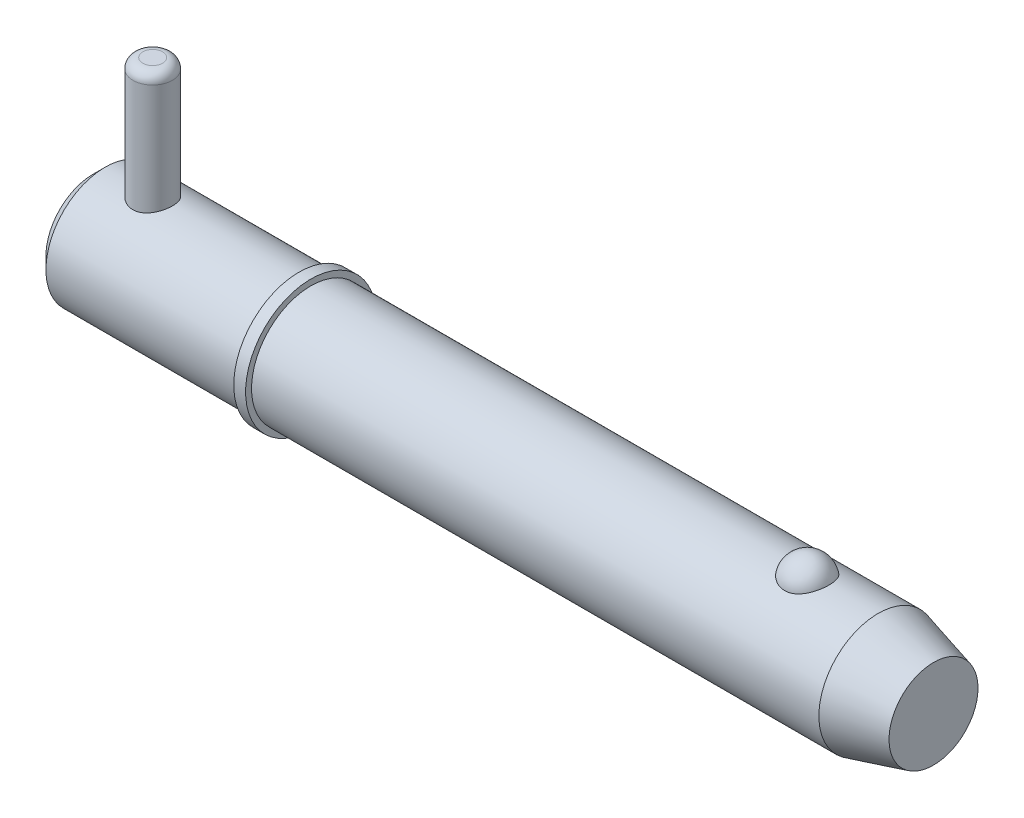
ISO-10303-21;
HEADER;
FILE_DESCRIPTION(('STEP AP214'),'2;1');
FILE_NAME('part.step','',(''),(''),'','','');
FILE_SCHEMA(('AUTOMOTIVE_DESIGN { 1 0 10303 214 1 1 1 1 }'));
ENDSEC;
DATA;
#1=APPLICATION_CONTEXT('core data for automotive mechanical design processes');
#2=APPLICATION_PROTOCOL_DEFINITION('international standard','automotive_design',2000,#1);
#3=PRODUCT_CONTEXT('',#1,'mechanical');
#4=PRODUCT('Part','Part','',(#3));
#5=PRODUCT_RELATED_PRODUCT_CATEGORY('part','',(#4));
#6=PRODUCT_DEFINITION_FORMATION('','',#4);
#7=PRODUCT_DEFINITION_CONTEXT('part definition',#1,'design');
#8=PRODUCT_DEFINITION('design','',#6,#7);
#9=PRODUCT_DEFINITION_SHAPE('','',#8);
#10=(LENGTH_UNIT() NAMED_UNIT(*) SI_UNIT(.MILLI.,.METRE.));
#11=(NAMED_UNIT(*) PLANE_ANGLE_UNIT() SI_UNIT($,.RADIAN.));
#12=(NAMED_UNIT(*) SI_UNIT($,.STERADIAN.) SOLID_ANGLE_UNIT());
#13=UNCERTAINTY_MEASURE_WITH_UNIT(LENGTH_MEASURE(1.E-05),#10,'distance_accuracy_value','');
#14=(GEOMETRIC_REPRESENTATION_CONTEXT(3) GLOBAL_UNCERTAINTY_ASSIGNED_CONTEXT((#13)) GLOBAL_UNIT_ASSIGNED_CONTEXT((#10,
#11,#12)) REPRESENTATION_CONTEXT('',''));
#15=CARTESIAN_POINT('',(0.,0.,0.));
#16=DIRECTION('',(0.,0.,1.));
#17=DIRECTION('',(1.,0.,0.));
#18=AXIS2_PLACEMENT_3D('',#15,#16,#17);
#19=CARTESIAN_POINT('',(9.52500000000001,28.575,0.));
#20=DIRECTION('',(0.,-1.,0.));
#21=DIRECTION('',(0.,0.,-1.));
#22=AXIS2_PLACEMENT_3D('',#19,#20,#21);
#23=CYLINDRICAL_SURFACE('',#22,3.175);
#24=CARTESIAN_POINT('',(9.52500000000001,-7.93750000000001,0.));
#25=DIRECTION('',(0.,1.,0.));
#26=DIRECTION('',(0.,0.,1.));
#27=AXIS2_PLACEMENT_3D('',#24,#25,#26);
#28=CIRCLE('',#27,3.175);
#29=CARTESIAN_POINT('',(9.52500000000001,-7.93750000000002,-3.175));
#30=VERTEX_POINT('',#29);
#31=EDGE_CURVE('P0_E25',#30,#30,#28,.T.);
#32=CARTESIAN_POINT('',(9.52500000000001,26.9875,0.));
#33=DIRECTION('',(0.,1.,0.));
#34=DIRECTION('',(0.,0.,1.));
#35=AXIS2_PLACEMENT_3D('',#32,#33,#34);
#36=CIRCLE('',#35,3.175);
#37=CARTESIAN_POINT('',(9.52500000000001,26.9875,-3.175));
#38=VERTEX_POINT('',#37);
#39=EDGE_CURVE('P0_E29',#38,#38,#36,.F.);
#40=CARTESIAN_POINT('',(9.52500000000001,-7.93750000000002,-3.175));
#41=CARTESIAN_POINT('',(9.52500000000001,-7.57369791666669,-3.175));
#42=CARTESIAN_POINT('',(9.52500000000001,-7.20989583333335,-3.175));
#43=CARTESIAN_POINT('',(9.52500000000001,-6.48229166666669,-3.175));
#44=CARTESIAN_POINT('',(9.52500000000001,-6.11848958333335,-3.175));
#45=CARTESIAN_POINT('',(9.52500000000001,-5.39088541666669,-3.175));
#46=CARTESIAN_POINT('',(9.52500000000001,-5.02708333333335,-3.175));
#47=CARTESIAN_POINT('',(9.52500000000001,-4.29947916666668,-3.175));
#48=CARTESIAN_POINT('',(9.52500000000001,-3.93567708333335,-3.175));
#49=CARTESIAN_POINT('',(9.52500000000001,-3.20807291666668,-3.175));
#50=CARTESIAN_POINT('',(9.52500000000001,-2.84427083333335,-3.175));
#51=CARTESIAN_POINT('',(9.52500000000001,-2.11666666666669,-3.175));
#52=CARTESIAN_POINT('',(9.52500000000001,-1.75286458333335,-3.175));
#53=CARTESIAN_POINT('',(9.52500000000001,-1.02526041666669,-3.175));
#54=CARTESIAN_POINT('',(9.52500000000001,-0.661458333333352,-3.175));
#55=CARTESIAN_POINT('',(9.52500000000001,0.0661458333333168,-3.175));
#56=CARTESIAN_POINT('',(9.52500000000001,0.429947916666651,-3.175));
#57=CARTESIAN_POINT('',(9.52500000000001,1.15755208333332,-3.175));
#58=CARTESIAN_POINT('',(9.52500000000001,1.52135416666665,-3.175));
#59=CARTESIAN_POINT('',(9.52500000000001,2.24895833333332,-3.175));
#60=CARTESIAN_POINT('',(9.52500000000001,2.61276041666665,-3.175));
#61=CARTESIAN_POINT('',(9.52500000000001,3.34036458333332,-3.175));
#62=CARTESIAN_POINT('',(9.52500000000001,3.70416666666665,-3.175));
#63=CARTESIAN_POINT('',(9.52500000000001,4.43177083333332,-3.175));
#64=CARTESIAN_POINT('',(9.52500000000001,4.79557291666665,-3.175));
#65=CARTESIAN_POINT('',(9.52500000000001,5.52317708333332,-3.175));
#66=CARTESIAN_POINT('',(9.52500000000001,5.88697916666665,-3.175));
#67=CARTESIAN_POINT('',(9.52500000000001,6.61458333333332,-3.175));
#68=CARTESIAN_POINT('',(9.52500000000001,6.97838541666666,-3.175));
#69=CARTESIAN_POINT('',(9.52500000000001,7.70598958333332,-3.175));
#70=CARTESIAN_POINT('',(9.52500000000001,8.06979166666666,-3.175));
#71=CARTESIAN_POINT('',(9.52500000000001,8.79739583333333,-3.175));
#72=CARTESIAN_POINT('',(9.52500000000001,9.16119791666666,-3.175));
#73=CARTESIAN_POINT('',(9.52500000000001,9.88880208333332,-3.175));
#74=CARTESIAN_POINT('',(9.52500000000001,10.2526041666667,-3.175));
#75=CARTESIAN_POINT('',(9.52500000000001,10.9802083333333,-3.175));
#76=CARTESIAN_POINT('',(9.52500000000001,11.3440104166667,-3.175));
#77=CARTESIAN_POINT('',(9.52500000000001,12.0716145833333,-3.175));
#78=CARTESIAN_POINT('',(9.52500000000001,12.4354166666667,-3.175));
#79=CARTESIAN_POINT('',(9.52500000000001,13.1630208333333,-3.175));
#80=CARTESIAN_POINT('',(9.52500000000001,13.5268229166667,-3.175));
#81=CARTESIAN_POINT('',(9.52500000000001,14.2544270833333,-3.175));
#82=CARTESIAN_POINT('',(9.52500000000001,14.6182291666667,-3.175));
#83=CARTESIAN_POINT('',(9.52500000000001,15.3458333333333,-3.175));
#84=CARTESIAN_POINT('',(9.52500000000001,15.7096354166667,-3.175));
#85=CARTESIAN_POINT('',(9.52500000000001,16.4372395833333,-3.175));
#86=CARTESIAN_POINT('',(9.52500000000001,16.8010416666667,-3.175));
#87=CARTESIAN_POINT('',(9.52500000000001,17.5286458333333,-3.175));
#88=CARTESIAN_POINT('',(9.52500000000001,17.8924479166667,-3.175));
#89=CARTESIAN_POINT('',(9.52500000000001,18.6200520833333,-3.175));
#90=CARTESIAN_POINT('',(9.52500000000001,18.9838541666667,-3.175));
#91=CARTESIAN_POINT('',(9.52500000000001,19.7114583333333,-3.175));
#92=CARTESIAN_POINT('',(9.52500000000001,20.0752604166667,-3.175));
#93=CARTESIAN_POINT('',(9.52500000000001,20.8028645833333,-3.175));
#94=CARTESIAN_POINT('',(9.52500000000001,21.1666666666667,-3.175));
#95=CARTESIAN_POINT('',(9.52500000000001,21.8942708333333,-3.175));
#96=CARTESIAN_POINT('',(9.52500000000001,22.2580729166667,-3.175));
#97=CARTESIAN_POINT('',(9.52500000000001,22.9856770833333,-3.175));
#98=CARTESIAN_POINT('',(9.52500000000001,23.3494791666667,-3.175));
#99=CARTESIAN_POINT('',(9.52500000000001,24.0770833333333,-3.175));
#100=CARTESIAN_POINT('',(9.52500000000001,24.4408854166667,-3.175));
#101=CARTESIAN_POINT('',(9.52500000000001,25.1684895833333,-3.175));
#102=CARTESIAN_POINT('',(9.52500000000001,25.5322916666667,-3.175));
#103=CARTESIAN_POINT('',(9.52500000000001,26.2598958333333,-3.175));
#104=CARTESIAN_POINT('',(9.52500000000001,26.6236979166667,-3.175));
#105=CARTESIAN_POINT('',(9.52500000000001,26.9875,-3.175));
#106=B_SPLINE_CURVE_WITH_KNOTS('',3,(#40,#41,#42,#43,#44,#45,#46,#47,#48,#49,#50,#51,#52,#53,
#54,#55,#56,#57,#58,#59,#60,#61,#62,#63,#64,#65,#66,#67,#68,#69,#70,#71,#72,#73,#74,#75,#76,#77,
#78,#79,#80,#81,#82,#83,#84,#85,#86,#87,#88,#89,#90,#91,#92,#93,#94,#95,#96,#97,#98,#99,#100,
#101,#102,#103,#104,#105),.UNSPECIFIED.,.F.,.F.,(4,2,2,2,2,2,2,2,2,2,2,2,2,2,2,2,2,2,2,2,2,2,2,
2,2,2,2,2,2,2,2,2,4),(0.,1.09140625,2.1828125,3.27421875,4.365625,5.45703125,6.5484375,
7.63984375,8.73125000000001,9.82265625,10.9140625,12.00546875,13.096875,14.18828125,15.2796875,
16.37109375,17.4625,18.55390625,19.6453125,20.73671875,21.828125,22.91953125,24.0109375,
25.10234375,26.19375,27.28515625,28.3765625,29.46796875,30.559375,31.65078125,32.7421875,
33.83359375,34.925),.UNSPECIFIED.);
#107=EDGE_CURVE('P0_BSEAM14',#30,#38,#106,.T.);
#108=ORIENTED_EDGE('',*,*,#31,.T.);
#109=ORIENTED_EDGE('',*,*,#39,.T.);
#110=ORIENTED_EDGE('',*,*,#107,.T.);
#111=ORIENTED_EDGE('',*,*,#107,.F.);
#112=EDGE_LOOP('',(#108,#110,#109,#111));
#113=FACE_BOUND('',#112,.T.);
#114=ADVANCED_FACE('P0_F14',(#113),#23,.T.);
#115=CARTESIAN_POINT('',(9.52500000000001,28.575,0.));
#116=DIRECTION('',(0.,1.,0.));
#117=DIRECTION('',(0.,0.,1.));
#118=AXIS2_PLACEMENT_3D('',#115,#116,#117);
#119=PLANE('',#118);
#120=CARTESIAN_POINT('',(9.52500000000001,28.575,0.));
#121=DIRECTION('',(0.,1.,0.));
#122=DIRECTION('',(0.,0.,1.));
#123=AXIS2_PLACEMENT_3D('',#120,#121,#122);
#124=CIRCLE('',#123,1.5875);
#125=CARTESIAN_POINT('',(9.52500000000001,28.575,1.5875));
#126=VERTEX_POINT('',#125);
#127=EDGE_CURVE('P0_E10',#126,#126,#124,.T.);
#128=ORIENTED_EDGE('',*,*,#127,.T.);
#129=EDGE_LOOP('',(#128));
#130=FACE_BOUND('',#129,.T.);
#131=ADVANCED_FACE('P0_F46',(#130),#119,.T.);
#132=CARTESIAN_POINT('',(9.52500000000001,-9.525,0.));
#133=DIRECTION('',(0.,1.,0.));
#134=DIRECTION('',(0.,0.,1.));
#135=AXIS2_PLACEMENT_3D('',#132,#133,#134);
#136=PLANE('',#135);
#137=CARTESIAN_POINT('',(9.52500000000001,-9.525,0.));
#138=DIRECTION('',(0.,1.,0.));
#139=DIRECTION('',(0.,0.,1.));
#140=AXIS2_PLACEMENT_3D('',#137,#138,#139);
#141=CIRCLE('',#140,1.5875);
#142=CARTESIAN_POINT('',(9.52500000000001,-9.525,1.5875));
#143=VERTEX_POINT('',#142);
#144=EDGE_CURVE('P0_E21',#143,#143,#141,.F.);
#145=ORIENTED_EDGE('',*,*,#144,.T.);
#146=EDGE_LOOP('',(#145));
#147=FACE_BOUND('',#146,.T.);
#148=ADVANCED_FACE('P0_F43',(#147),#136,.F.);
#149=CARTESIAN_POINT('',(9.52500000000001,-7.9375,0.));
#150=DIRECTION('',(0.,1.,0.));
#151=DIRECTION('',(0.,0.,1.));
#152=AXIS2_PLACEMENT_3D('',#149,#150,#151);
#153=DEGENERATE_TOROIDAL_SURFACE('',#152,1.5875,1.5875,.T.);
#154=ORIENTED_EDGE('',*,*,#144,.F.);
#155=EDGE_LOOP('',(#154));
#156=FACE_BOUND('',#155,.T.);
#157=ORIENTED_EDGE('',*,*,#31,.F.);
#158=EDGE_LOOP('',(#157));
#159=FACE_BOUND('',#158,.T.);
#160=ADVANCED_FACE('P0_F38',(#156,#159),#153,.T.);
#161=CARTESIAN_POINT('',(9.52500000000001,26.9875,0.));
#162=DIRECTION('',(0.,1.,0.));
#163=DIRECTION('',(0.,0.,1.));
#164=AXIS2_PLACEMENT_3D('',#161,#162,#163);
#165=DEGENERATE_TOROIDAL_SURFACE('',#164,1.5875,1.5875,.T.);
#166=ORIENTED_EDGE('',*,*,#39,.F.);
#167=EDGE_LOOP('',(#166));
#168=FACE_BOUND('',#167,.T.);
#169=ORIENTED_EDGE('',*,*,#127,.F.);
#170=EDGE_LOOP('',(#169));
#171=FACE_BOUND('',#170,.T.);
#172=ADVANCED_FACE('P0_F16',(#168,#171),#165,.T.);
#173=CLOSED_SHELL('',(#114,#131,#148,#160,#172));
#174=MANIFOLD_SOLID_BREP('P0_B1',#173);
#175=CARTESIAN_POINT('',(0.,0.,0.));
#176=DIRECTION('',(1.,0.,0.));
#177=DIRECTION('',(0.,0.,-1.));
#178=AXIS2_PLACEMENT_3D('',#175,#176,#177);
#179=CYLINDRICAL_SURFACE('',#178,9.525);
#180=CARTESIAN_POINT('',(126.043054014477,0.,0.));
#181=DIRECTION('',(1.,0.,0.));
#182=DIRECTION('',(0.,0.,-1.));
#183=AXIS2_PLACEMENT_3D('',#180,#181,#182);
#184=CIRCLE('',#183,9.525);
#185=CARTESIAN_POINT('',(126.043054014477,0.,-9.525));
#186=VERTEX_POINT('',#185);
#187=EDGE_CURVE('P1_E81',#186,#186,#184,.T.);
#188=ORIENTED_EDGE('',*,*,#187,.F.);
#189=EDGE_LOOP('',(#188));
#190=FACE_BOUND('',#189,.T.);
#191=CARTESIAN_POINT('',(34.93,0.,0.));
#192=DIRECTION('',(1.,0.,0.));
#193=DIRECTION('',(0.,0.,-1.));
#194=AXIS2_PLACEMENT_3D('',#191,#192,#193);
#195=CIRCLE('',#194,9.525);
#196=CARTESIAN_POINT('',(34.93,0.,-9.525));
#197=VERTEX_POINT('',#196);
#198=EDGE_CURVE('P1_E85',#197,#197,#195,.T.);
#199=ORIENTED_EDGE('',*,*,#198,.T.);
#200=EDGE_LOOP('',(#199));
#201=FACE_BOUND('',#200,.T.);
#202=CARTESIAN_POINT('',(114.645757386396,8.80405803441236,3.63513233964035));
#203=CARTESIAN_POINT('',(114.551676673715,8.80405953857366,3.63513053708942));
#204=CARTESIAN_POINT('',(114.457561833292,8.80561325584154,3.6313746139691));
#205=CARTESIAN_POINT('',(114.270012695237,8.81177748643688,3.61638665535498));
#206=CARTESIAN_POINT('',(114.176578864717,8.81638992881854,3.60514990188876));
#207=CARTESIAN_POINT('',(113.897945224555,8.8346711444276,3.56024627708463));
#208=CARTESIAN_POINT('',(113.714691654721,8.85278327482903,3.51538626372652));
#209=CARTESIAN_POINT('',(113.359509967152,8.89871214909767,3.39742145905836));
#210=CARTESIAN_POINT('',(113.187553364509,8.9265032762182,3.32439116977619));
#211=CARTESIAN_POINT('',(112.858707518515,8.98874819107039,3.15220244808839));
#212=CARTESIAN_POINT('',(112.701811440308,9.02319893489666,3.05305594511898));
#213=CARTESIAN_POINT('',(112.402214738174,9.09629186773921,2.82797815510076));
#214=CARTESIAN_POINT('',(112.260060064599,9.13502685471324,2.7013513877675));
#215=CARTESIAN_POINT('',(111.998299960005,9.2118657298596,2.4264193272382));
#216=CARTESIAN_POINT('',(111.878701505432,9.2499694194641,2.27810735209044));
#217=CARTESIAN_POINT('',(111.659645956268,9.3234108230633,1.95652290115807));
#218=CARTESIAN_POINT('',(111.561317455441,9.35855090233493,1.78243511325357));
#219=CARTESIAN_POINT('',(111.393819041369,9.42045142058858,1.41937246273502));
#220=CARTESIAN_POINT('',(111.324651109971,9.44721128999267,1.23039658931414));
#221=CARTESIAN_POINT('',(111.216199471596,9.48990641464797,0.840370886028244));
#222=CARTESIAN_POINT('',(111.177288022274,9.50570658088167,0.639202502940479));
#223=CARTESIAN_POINT('',(111.131555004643,9.52433146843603,0.232664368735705));
#224=CARTESIAN_POINT('',(111.124732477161,9.52715657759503,0.0272947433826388));
#225=CARTESIAN_POINT('',(111.143255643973,9.51956918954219,-0.380478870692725));
#226=CARTESIAN_POINT('',(111.168405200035,9.50923740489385,-0.58289331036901));
#227=CARTESIAN_POINT('',(111.25002537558,9.47651897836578,-0.980293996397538));
#228=CARTESIAN_POINT('',(111.306496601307,9.45413210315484,-1.17528009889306));
#229=CARTESIAN_POINT('',(111.449719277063,9.39954044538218,-1.55263697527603));
#230=CARTESIAN_POINT('',(111.536512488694,9.36732213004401,-1.73498993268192));
#231=CARTESIAN_POINT('',(111.738610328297,9.29640700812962,-2.08177763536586));
#232=CARTESIAN_POINT('',(111.853917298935,9.25770966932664,-2.24621090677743));
#233=CARTESIAN_POINT('',(112.111264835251,9.17775604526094,-2.5533833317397));
#234=CARTESIAN_POINT('',(112.253434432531,9.136488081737,-2.696011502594));
#235=CARTESIAN_POINT('',(112.56089985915,9.05620497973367,-2.95451229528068));
#236=CARTESIAN_POINT('',(112.726193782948,9.01718965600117,-3.07038711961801));
#237=CARTESIAN_POINT('',(113.072052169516,8.9468001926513,-3.26976836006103));
#238=CARTESIAN_POINT('',(113.252227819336,8.91528408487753,-3.35389750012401));
#239=CARTESIAN_POINT('',(113.625651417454,8.86272514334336,-3.49043503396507));
#240=CARTESIAN_POINT('',(113.818894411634,8.8416783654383,-3.54285537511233));
#241=CARTESIAN_POINT('',(114.202503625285,8.81348056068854,-3.61241306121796));
#242=CARTESIAN_POINT('',(114.392525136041,8.80568348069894,-3.63119339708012));
#243=CARTESIAN_POINT('',(114.773190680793,8.80289410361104,-3.63795342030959));
#244=CARTESIAN_POINT('',(114.963834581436,8.80789922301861,-3.62593932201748));
#245=CARTESIAN_POINT('',(115.334007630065,8.8297491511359,-3.57238430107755));
#246=CARTESIAN_POINT('',(115.513697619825,8.84621463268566,-3.53178890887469));
#247=CARTESIAN_POINT('',(115.863422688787,8.88875330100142,-3.42331083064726));
#248=CARTESIAN_POINT('',(116.033456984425,8.91482726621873,-3.35542593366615));
#249=CARTESIAN_POINT('',(116.363237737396,8.97448239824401,-3.19248225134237));
#250=CARTESIAN_POINT('',(116.522680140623,9.00821446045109,-3.09686474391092));
#251=CARTESIAN_POINT('',(116.823513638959,9.07935398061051,-2.88162736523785));
#252=CARTESIAN_POINT('',(116.964900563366,9.11676228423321,-2.76200196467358));
#253=CARTESIAN_POINT('',(117.23331931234,9.19347419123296,-2.49516285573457));
#254=CARTESIAN_POINT('',(117.359275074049,9.23277872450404,-2.34686614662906));
#255=CARTESIAN_POINT('',(117.585522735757,9.30737610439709,-2.03093683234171));
#256=CARTESIAN_POINT('',(117.68581004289,9.34266823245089,-1.86330077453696));
#257=CARTESIAN_POINT('',(117.861514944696,9.40674710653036,-1.50744893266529));
#258=CARTESIAN_POINT('',(117.936041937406,9.4352917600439,-1.31874876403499));
#259=CARTESIAN_POINT('',(118.05416505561,9.48144132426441,-0.930631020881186));
#260=CARTESIAN_POINT('',(118.097760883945,9.49904612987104,-0.731213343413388));
#261=CARTESIAN_POINT('',(118.153158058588,9.5215314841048,-0.327147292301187));
#262=CARTESIAN_POINT('',(118.164935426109,9.52640243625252,-0.122495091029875));
#263=CARTESIAN_POINT('',(118.156382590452,9.52289571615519,0.286018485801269));
#264=CARTESIAN_POINT('',(118.13605305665,9.51451832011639,0.489879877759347));
#265=CARTESIAN_POINT('',(118.063884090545,9.48544083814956,0.88999431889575));
#266=CARTESIAN_POINT('',(118.012199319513,9.46480124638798,1.08627971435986));
#267=CARTESIAN_POINT('',(117.878491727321,9.4133389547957,1.46682086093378));
#268=CARTESIAN_POINT('',(117.796466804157,9.38251554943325,1.65107577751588));
#269=CARTESIAN_POINT('',(117.60319292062,9.31365636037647,2.00346348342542));
#270=CARTESIAN_POINT('',(117.491783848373,9.27558138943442,2.17150083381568));
#271=CARTESIAN_POINT('',(117.242294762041,9.19638714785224,2.48563115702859));
#272=CARTESIAN_POINT('',(117.104216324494,9.15526805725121,2.63172542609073));
#273=CARTESIAN_POINT('',(116.804843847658,9.07465393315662,2.89750997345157));
#274=CARTESIAN_POINT('',(116.643610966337,9.03515496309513,3.01726776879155));
#275=CARTESIAN_POINT('',(116.301613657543,8.96227564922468,3.22732920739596));
#276=CARTESIAN_POINT('',(116.120841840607,8.92889763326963,3.31762165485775));
#277=CARTESIAN_POINT('',(115.751445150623,8.8734538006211,3.46314419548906));
#278=CARTESIAN_POINT('',(115.56332371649,8.85102983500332,3.51950082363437));
#279=CARTESIAN_POINT('',(115.27578699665,8.8266696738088,3.57993683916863));
#280=CARTESIAN_POINT('',(115.179133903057,8.82009725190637,3.59606217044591));
#281=CARTESIAN_POINT('',(114.984677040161,8.81020897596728,3.62022512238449));
#282=CARTESIAN_POINT('',(114.88687410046,8.80689090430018,3.62826825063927));
#283=CARTESIAN_POINT('',(114.741224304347,8.80445615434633,3.63416760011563));
#284=CARTESIAN_POINT('',(114.693495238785,8.80405727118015,3.63513325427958));
#285=CARTESIAN_POINT('',(114.645757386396,8.80405803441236,3.63513233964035));
#286=B_SPLINE_CURVE_WITH_KNOTS('',3,(#202,#203,#204,#205,#206,#207,#208,#209,#210,#211,#212,
#213,#214,#215,#216,#217,#218,#219,#220,#221,#222,#223,#224,#225,#226,#227,#228,#229,#230,#231,
#232,#233,#234,#235,#236,#237,#238,#239,#240,#241,#242,#243,#244,#245,#246,#247,#248,#249,#250,
#251,#252,#253,#254,#255,#256,#257,#258,#259,#260,#261,#262,#263,#264,#265,#266,#267,#268,#269,
#270,#271,#272,#273,#274,#275,#276,#277,#278,#279,#280,#281,#282,#283,#284,#285),.UNSPECIFIED.,
.T.,.F.,(4,2,2,2,2,2,2,2,2,2,2,2,2,2,2,2,2,2,2,2,2,2,2,2,2,2,2,2,2,2,2,2,2,2,2,2,2,2,2,2,2,4),
(0.,0.282202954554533,0.564584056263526,1.13017050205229,1.69427128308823,2.258114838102,
2.83836627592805,3.41879688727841,4.02497117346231,4.63118665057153,5.24474754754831,
5.85829010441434,6.46808687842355,7.07789545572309,7.68854723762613,8.29924920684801,
8.91296283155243,9.52662591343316,10.1275338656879,10.7282152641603,11.2986646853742,
11.868998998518,12.4213015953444,12.973648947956,13.5380053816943,14.1024919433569,
14.695298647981,15.2882113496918,15.8999469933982,16.5116885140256,17.1238909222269,
17.7360805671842,18.3452748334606,18.9545113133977,19.567138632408,20.1797297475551,
20.7907316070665,21.4019653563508,21.9915938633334,22.2859053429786,22.5800161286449,
22.723209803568),.UNSPECIFIED.);
#287=CARTESIAN_POINT('',(114.645757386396,8.80405803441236,3.63513233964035));
#288=VERTEX_POINT('',#287);
#289=EDGE_CURVE('P1_E35',#288,#288,#286,.T.);
#290=ORIENTED_EDGE('',*,*,#289,.T.);
#291=EDGE_LOOP('',(#290));
#292=FACE_BOUND('',#291,.T.);
#293=ADVANCED_FACE('P1_F13',(#190,#201,#292),#179,.T.);
#294=CARTESIAN_POINT('',(0.,0.,0.));
#295=DIRECTION('',(-1.,0.,0.));
#296=DIRECTION('',(0.,0.,1.));
#297=AXIS2_PLACEMENT_3D('',#294,#295,#296);
#298=PLANE('',#297);
#299=CARTESIAN_POINT('',(0.,0.,0.));
#300=DIRECTION('',(1.,0.,0.));
#301=DIRECTION('',(0.,0.,-1.));
#302=AXIS2_PLACEMENT_3D('',#299,#300,#301);
#303=CIRCLE('',#302,7.62);
#304=CARTESIAN_POINT('',(0.,0.,-7.62));
#305=VERTEX_POINT('',#304);
#306=EDGE_CURVE('P1_E9',#305,#305,#303,.T.);
#307=ORIENTED_EDGE('',*,*,#306,.F.);
#308=EDGE_LOOP('',(#307));
#309=FACE_BOUND('',#308,.T.);
#310=ADVANCED_FACE('P1_F15',(#309),#298,.T.);
#311=CARTESIAN_POINT('',(1.90499999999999,0.,0.));
#312=DIRECTION('',(1.,0.,0.));
#313=DIRECTION('',(0.,0.,-1.));
#314=AXIS2_PLACEMENT_3D('',#311,#312,#313);
#315=CONICAL_SURFACE('',#314,9.525,0.785398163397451);
#316=ORIENTED_EDGE('',*,*,#306,.T.);
#317=EDGE_LOOP('',(#316));
#318=FACE_BOUND('',#317,.T.);
#319=CARTESIAN_POINT('',(1.90499999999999,0.,0.));
#320=DIRECTION('',(1.,0.,0.));
#321=DIRECTION('',(0.,0.,-1.));
#322=AXIS2_PLACEMENT_3D('',#319,#320,#321);
#323=CIRCLE('',#322,9.525);
#324=CARTESIAN_POINT('',(1.90499999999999,0.,-9.525));
#325=VERTEX_POINT('',#324);
#326=EDGE_CURVE('P1_E26',#325,#325,#323,.T.);
#327=ORIENTED_EDGE('',*,*,#326,.F.);
#328=EDGE_LOOP('',(#327));
#329=FACE_BOUND('',#328,.T.);
#330=ADVANCED_FACE('P1_F77',(#318,#329),#315,.T.);
#331=CARTESIAN_POINT('',(0.,0.,0.));
#332=DIRECTION('',(1.,0.,0.));
#333=DIRECTION('',(0.,0.,-1.));
#334=AXIS2_PLACEMENT_3D('',#331,#332,#333);
#335=CYLINDRICAL_SURFACE('',#334,9.525);
#336=CARTESIAN_POINT('',(9.525,-8.98025612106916,3.175));
#337=CARTESIAN_POINT('',(9.35206354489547,-8.98025555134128,3.17500081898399));
#338=CARTESIAN_POINT('',(9.17913201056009,-8.98530617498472,3.16082293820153));
#339=CARTESIAN_POINT('',(8.83839221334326,-9.00485797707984,3.10467734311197));
#340=CARTESIAN_POINT('',(8.67058479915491,-9.0193607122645,3.06270505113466));
#341=CARTESIAN_POINT('',(8.34508461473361,-9.05599546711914,2.95260866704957));
#342=CARTESIAN_POINT('',(8.18737272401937,-9.07811252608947,2.88453582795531));
#343=CARTESIAN_POINT('',(7.88555684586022,-9.12746212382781,2.72434567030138));
#344=CARTESIAN_POINT('',(7.74145587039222,-9.1546957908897,2.63222304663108));
#345=CARTESIAN_POINT('',(7.46531411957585,-9.21240503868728,2.42268738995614));
#346=CARTESIAN_POINT('',(7.33388351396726,-9.24296141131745,2.30449228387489));
#347=CARTESIAN_POINT('',(7.09229340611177,-9.30319020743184,2.0478358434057));
#348=CARTESIAN_POINT('',(6.98213731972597,-9.33286248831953,1.90937126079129));
#349=CARTESIAN_POINT('',(6.78345450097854,-9.38891527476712,1.61164431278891));
#350=CARTESIAN_POINT('',(6.69556709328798,-9.41518969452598,1.45193356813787));
#351=CARTESIAN_POINT('',(6.54814671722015,-9.46053437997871,1.11896913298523));
#352=CARTESIAN_POINT('',(6.48860610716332,-9.47960658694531,0.945719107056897));
#353=CARTESIAN_POINT('',(6.40163866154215,-9.50782564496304,0.596991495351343));
#354=CARTESIAN_POINT('',(6.373166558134,-9.5172947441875,0.421801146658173));
#355=CARTESIAN_POINT('',(6.3458207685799,-9.52638456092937,0.068890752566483));
#356=CARTESIAN_POINT('',(6.34693945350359,-9.52600781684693,-0.108828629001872));
#357=CARTESIAN_POINT('',(6.37808050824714,-9.51566675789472,-0.454353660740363));
#358=CARTESIAN_POINT('',(6.4069675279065,-9.50607905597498,-0.622274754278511));
#359=CARTESIAN_POINT('',(6.490947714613,-9.47886621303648,-0.950732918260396));
#360=CARTESIAN_POINT('',(6.54604265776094,-9.46124052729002,-1.11126948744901));
#361=CARTESIAN_POINT('',(6.68153768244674,-9.41945253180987,-1.42288410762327));
#362=CARTESIAN_POINT('',(6.76226085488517,-9.3952073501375,-1.57381010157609));
#363=CARTESIAN_POINT('',(6.94645456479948,-9.34270397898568,-1.86030973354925));
#364=CARTESIAN_POINT('',(7.04993142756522,-9.31444467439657,-1.99587908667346));
#365=CARTESIAN_POINT('',(7.28241619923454,-9.25532159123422,-2.2545702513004));
#366=CARTESIAN_POINT('',(7.4123967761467,-9.22439783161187,-2.37680549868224));
#367=CARTESIAN_POINT('',(7.69127470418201,-9.1645528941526,-2.5980302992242));
#368=CARTESIAN_POINT('',(7.84017496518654,-9.13563202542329,-2.6970162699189));
#369=CARTESIAN_POINT('',(8.15547526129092,-9.08273917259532,-2.87016016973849));
#370=CARTESIAN_POINT('',(8.32209451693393,-9.05884361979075,-2.94394402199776));
#371=CARTESIAN_POINT('',(8.66638917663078,-9.01959241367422,-3.06210713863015));
#372=CARTESIAN_POINT('',(8.84405991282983,-9.00423318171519,-3.10649872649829));
#373=CARTESIAN_POINT('',(9.19682677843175,-8.98460345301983,-3.16281207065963));
#374=CARTESIAN_POINT('',(9.37167742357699,-8.9798639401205,-3.17610837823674));
#375=CARTESIAN_POINT('',(9.72113927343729,-8.9806993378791,-3.17374726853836));
#376=CARTESIAN_POINT('',(9.89575051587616,-8.98627237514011,-3.15809511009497));
#377=CARTESIAN_POINT('',(10.2335233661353,-9.00663737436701,-3.09951644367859));
#378=CARTESIAN_POINT('',(10.3968722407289,-9.02110608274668,-3.05754530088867));
#379=CARTESIAN_POINT('',(10.7141759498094,-9.05727657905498,-2.94866651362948));
#380=CARTESIAN_POINT('',(10.8681291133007,-9.07897964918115,-2.88175444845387));
#381=CARTESIAN_POINT('',(11.1676828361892,-9.12802586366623,-2.72248103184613));
#382=CARTESIAN_POINT('',(11.3128635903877,-9.1555260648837,-2.62937980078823));
#383=CARTESIAN_POINT('',(11.5860387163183,-9.21276315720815,-2.42120937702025));
#384=CARTESIAN_POINT('',(11.7140280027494,-9.24250070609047,-2.30613370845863));
#385=CARTESIAN_POINT('',(11.9555513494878,-9.30259247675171,-2.05070616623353));
#386=CARTESIAN_POINT('',(12.0680936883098,-9.33290753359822,-1.90940458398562));
#387=CARTESIAN_POINT('',(12.267933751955,-9.3893275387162,-1.60917665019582));
#388=CARTESIAN_POINT('',(12.3552323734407,-9.41543263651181,-1.45025092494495));
#389=CARTESIAN_POINT('',(12.5013088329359,-9.46036988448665,-1.12007606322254));
#390=CARTESIAN_POINT('',(12.5602723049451,-9.47924920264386,-0.9489158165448));
#391=CARTESIAN_POINT('',(12.6483355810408,-9.50781089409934,-0.598355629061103));
#392=CARTESIAN_POINT('',(12.6774461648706,-9.5174965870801,-0.4189586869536));
#393=CARTESIAN_POINT('',(12.7040070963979,-9.52632915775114,-0.066088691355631));
#394=CARTESIAN_POINT('',(12.7028811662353,-9.52594996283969,0.107266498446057));
#395=CARTESIAN_POINT('',(12.6725130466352,-9.51586223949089,0.451202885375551));
#396=CARTESIAN_POINT('',(12.643273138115,-9.50615446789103,0.621784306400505));
#397=CARTESIAN_POINT('',(12.5584514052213,-9.47867404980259,0.952633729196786));
#398=CARTESIAN_POINT('',(12.5032953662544,-9.46103195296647,1.1130225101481));
#399=CARTESIAN_POINT('',(12.3686013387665,-9.41949985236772,1.42233126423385));
#400=CARTESIAN_POINT('',(12.2890589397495,-9.39560871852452,1.57124915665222));
#401=CARTESIAN_POINT('',(12.1044667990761,-9.34294133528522,1.85938800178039));
#402=CARTESIAN_POINT('',(11.9985831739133,-9.31401720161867,1.9980473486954));
#403=CARTESIAN_POINT('',(11.7657327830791,-9.25490239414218,2.25609475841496));
#404=CARTESIAN_POINT('',(11.6387592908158,-9.22471131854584,2.37547664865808));
#405=CARTESIAN_POINT('',(11.3613902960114,-9.16505913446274,2.59633024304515));
#406=CARTESIAN_POINT('',(11.2102725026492,-9.13567286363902,2.69691791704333));
#407=CARTESIAN_POINT('',(10.8923631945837,-9.08241113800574,2.87119803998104));
#408=CARTESIAN_POINT('',(10.7255757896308,-9.05853424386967,2.94489751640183));
#409=CARTESIAN_POINT('',(10.3887212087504,-9.02021736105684,3.06020415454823));
#410=CARTESIAN_POINT('',(10.219143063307,-9.00539959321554,3.10311136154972));
#411=CARTESIAN_POINT('',(9.87470703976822,-8.98542092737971,3.16050396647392));
#412=CARTESIAN_POINT('',(9.699851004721,-8.98025669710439,3.17499917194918));
#413=CARTESIAN_POINT('',(9.525,-8.98025612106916,3.175));
#414=B_SPLINE_CURVE_WITH_KNOTS('',3,(#336,#337,#338,#339,#340,#341,#342,#343,#344,#345,#346,
#347,#348,#349,#350,#351,#352,#353,#354,#355,#356,#357,#358,#359,#360,#361,#362,#363,#364,#365,
#366,#367,#368,#369,#370,#371,#372,#373,#374,#375,#376,#377,#378,#379,#380,#381,#382,#383,#384,
#385,#386,#387,#388,#389,#390,#391,#392,#393,#394,#395,#396,#397,#398,#399,#400,#401,#402,#403,
#404,#405,#406,#407,#408,#409,#410,#411,#412,#413),.UNSPECIFIED.,.T.,.F.,(4,2,2,2,2,2,2,2,2,2,2,
2,2,2,2,2,2,2,2,2,2,2,2,2,2,2,2,2,2,2,2,2,2,2,2,2,2,2,4),(0.,0.518161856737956,1.03640907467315,
1.55364379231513,2.07099270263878,2.60671746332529,3.14252816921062,3.69231882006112,
4.24196117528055,4.77247962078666,5.30286129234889,5.81244090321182,6.32205505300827,
6.83836754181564,7.3548237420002,7.89559553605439,8.43645060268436,8.98501631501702,
9.53335188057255,10.056948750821,10.5804505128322,11.0859695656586,11.5915782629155,
12.1132237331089,12.6350231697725,13.1819271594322,13.7288117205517,14.2720628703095,
14.815117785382,15.3326491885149,15.8501386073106,16.3594083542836,16.868770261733,
17.3969527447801,17.925304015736,18.4743376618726,19.023227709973,19.5473069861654,
20.0712053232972),.UNSPECIFIED.);
#415=CARTESIAN_POINT('',(9.525,-8.98025612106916,3.175));
#416=VERTEX_POINT('',#415);
#417=EDGE_CURVE('P1_E17',#416,#416,#414,.T.);
#418=ORIENTED_EDGE('',*,*,#417,.F.);
#419=EDGE_LOOP('',(#418));
#420=FACE_BOUND('',#419,.T.);
#421=CARTESIAN_POINT('',(9.525,8.98025612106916,3.175));
#422=CARTESIAN_POINT('',(9.69793645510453,8.98025555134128,3.17500081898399));
#423=CARTESIAN_POINT('',(9.87086798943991,8.98530617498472,3.16082293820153));
#424=CARTESIAN_POINT('',(10.2116077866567,9.00485797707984,3.10467734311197));
#425=CARTESIAN_POINT('',(10.3794152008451,9.0193607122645,3.06270505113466));
#426=CARTESIAN_POINT('',(10.7049153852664,9.05599546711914,2.95260866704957));
#427=CARTESIAN_POINT('',(10.8626272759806,9.07811252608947,2.88453582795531));
#428=CARTESIAN_POINT('',(11.1644431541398,9.12746212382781,2.72434567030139));
#429=CARTESIAN_POINT('',(11.3085441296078,9.15469579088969,2.63222304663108));
#430=CARTESIAN_POINT('',(11.5846858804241,9.21240503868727,2.42268738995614));
#431=CARTESIAN_POINT('',(11.7161164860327,9.24296141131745,2.30449228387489));
#432=CARTESIAN_POINT('',(11.9577065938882,9.30319020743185,2.0478358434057));
#433=CARTESIAN_POINT('',(12.067862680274,9.33286248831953,1.90937126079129));
#434=CARTESIAN_POINT('',(12.2665454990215,9.38891527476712,1.61164431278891));
#435=CARTESIAN_POINT('',(12.354432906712,9.41518969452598,1.45193356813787));
#436=CARTESIAN_POINT('',(12.5018532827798,9.46053437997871,1.11896913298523));
#437=CARTESIAN_POINT('',(12.5613938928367,9.47960658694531,0.945719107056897));
#438=CARTESIAN_POINT('',(12.6483613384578,9.50782564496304,0.596991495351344));
#439=CARTESIAN_POINT('',(12.676833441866,9.5172947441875,0.421801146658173));
#440=CARTESIAN_POINT('',(12.7041792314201,9.52638456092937,0.0688907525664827));
#441=CARTESIAN_POINT('',(12.7030605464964,9.52600781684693,-0.108828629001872));
#442=CARTESIAN_POINT('',(12.6719194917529,9.51566675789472,-0.454353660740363));
#443=CARTESIAN_POINT('',(12.6430324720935,9.50607905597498,-0.622274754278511));
#444=CARTESIAN_POINT('',(12.559052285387,9.47886621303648,-0.950732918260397));
#445=CARTESIAN_POINT('',(12.5039573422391,9.46124052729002,-1.11126948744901));
#446=CARTESIAN_POINT('',(12.3684623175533,9.41945253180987,-1.42288410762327));
#447=CARTESIAN_POINT('',(12.2877391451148,9.3952073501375,-1.57381010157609));
#448=CARTESIAN_POINT('',(12.1035454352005,9.34270397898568,-1.86030973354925));
#449=CARTESIAN_POINT('',(12.0000685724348,9.31444467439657,-1.99587908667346));
#450=CARTESIAN_POINT('',(11.7675838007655,9.25532159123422,-2.2545702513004));
#451=CARTESIAN_POINT('',(11.6376032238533,9.22439783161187,-2.37680549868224));
#452=CARTESIAN_POINT('',(11.358725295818,9.1645528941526,-2.5980302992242));
#453=CARTESIAN_POINT('',(11.2098250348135,9.13563202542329,-2.6970162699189));
#454=CARTESIAN_POINT('',(10.8945247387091,9.08273917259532,-2.87016016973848));
#455=CARTESIAN_POINT('',(10.7279054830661,9.05884361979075,-2.94394402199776));
#456=CARTESIAN_POINT('',(10.3836108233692,9.01959241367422,-3.06210713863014));
#457=CARTESIAN_POINT('',(10.2059400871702,9.00423318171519,-3.10649872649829));
#458=CARTESIAN_POINT('',(9.85317322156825,8.98460345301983,-3.16281207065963));
#459=CARTESIAN_POINT('',(9.67832257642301,8.9798639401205,-3.17610837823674));
#460=CARTESIAN_POINT('',(9.32886072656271,8.9806993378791,-3.17374726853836));
#461=CARTESIAN_POINT('',(9.15424948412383,8.98627237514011,-3.15809511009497));
#462=CARTESIAN_POINT('',(8.81647663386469,9.00663737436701,-3.09951644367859));
#463=CARTESIAN_POINT('',(8.65312775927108,9.02110608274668,-3.05754530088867));
#464=CARTESIAN_POINT('',(8.33582405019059,9.05727657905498,-2.94866651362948));
#465=CARTESIAN_POINT('',(8.18187088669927,9.07897964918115,-2.88175444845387));
#466=CARTESIAN_POINT('',(7.88231716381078,9.12802586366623,-2.72248103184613));
#467=CARTESIAN_POINT('',(7.73713640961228,9.1555260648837,-2.62937980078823));
#468=CARTESIAN_POINT('',(7.46396128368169,9.21276315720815,-2.42120937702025));
#469=CARTESIAN_POINT('',(7.33597199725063,9.24250070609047,-2.30613370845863));
#470=CARTESIAN_POINT('',(7.09444865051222,9.30259247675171,-2.05070616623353));
#471=CARTESIAN_POINT('',(6.98190631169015,9.33290753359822,-1.90940458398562));
#472=CARTESIAN_POINT('',(6.78206624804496,9.3893275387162,-1.60917665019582));
#473=CARTESIAN_POINT('',(6.6947676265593,9.41543263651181,-1.45025092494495));
#474=CARTESIAN_POINT('',(6.54869116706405,9.46036988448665,-1.12007606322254));
#475=CARTESIAN_POINT('',(6.48972769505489,9.47924920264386,-0.948915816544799));
#476=CARTESIAN_POINT('',(6.40166441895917,9.50781089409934,-0.598355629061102));
#477=CARTESIAN_POINT('',(6.3725538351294,9.5174965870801,-0.418958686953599));
#478=CARTESIAN_POINT('',(6.34599290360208,9.52632915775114,-0.0660886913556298));
#479=CARTESIAN_POINT('',(6.3471188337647,9.52594996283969,0.107266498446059));
#480=CARTESIAN_POINT('',(6.37748695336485,9.51586223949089,0.451202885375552));
#481=CARTESIAN_POINT('',(6.40672686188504,9.50615446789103,0.621784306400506));
#482=CARTESIAN_POINT('',(6.49154859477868,9.47867404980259,0.952633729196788));
#483=CARTESIAN_POINT('',(6.54670463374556,9.46103195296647,1.11302251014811));
#484=CARTESIAN_POINT('',(6.68139866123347,9.41949985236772,1.42233126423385));
#485=CARTESIAN_POINT('',(6.76094106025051,9.39560871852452,1.57124915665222));
#486=CARTESIAN_POINT('',(6.94553320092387,9.34294133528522,1.85938800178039));
#487=CARTESIAN_POINT('',(7.05141682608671,9.31401720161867,1.9980473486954));
#488=CARTESIAN_POINT('',(7.28426721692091,9.25490239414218,2.25609475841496));
#489=CARTESIAN_POINT('',(7.41124070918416,9.22471131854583,2.37547664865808));
#490=CARTESIAN_POINT('',(7.68860970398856,9.16505913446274,2.59633024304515));
#491=CARTESIAN_POINT('',(7.83972749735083,9.13567286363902,2.69691791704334));
#492=CARTESIAN_POINT('',(8.15763680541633,9.08241113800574,2.87119803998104));
#493=CARTESIAN_POINT('',(8.32442421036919,9.05853424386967,2.94489751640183));
#494=CARTESIAN_POINT('',(8.66127879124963,9.02021736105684,3.06020415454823));
#495=CARTESIAN_POINT('',(8.83085693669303,9.00539959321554,3.10311136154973));
#496=CARTESIAN_POINT('',(9.17529296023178,8.98542092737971,3.16050396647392));
#497=CARTESIAN_POINT('',(9.350148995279,8.98025669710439,3.17499917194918));
#498=CARTESIAN_POINT('',(9.525,8.98025612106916,3.175));
#499=B_SPLINE_CURVE_WITH_KNOTS('',3,(#421,#422,#423,#424,#425,#426,#427,#428,#429,#430,#431,
#432,#433,#434,#435,#436,#437,#438,#439,#440,#441,#442,#443,#444,#445,#446,#447,#448,#449,#450,
#451,#452,#453,#454,#455,#456,#457,#458,#459,#460,#461,#462,#463,#464,#465,#466,#467,#468,#469,
#470,#471,#472,#473,#474,#475,#476,#477,#478,#479,#480,#481,#482,#483,#484,#485,#486,#487,#488,
#489,#490,#491,#492,#493,#494,#495,#496,#497,#498),.UNSPECIFIED.,.T.,.F.,(4,2,2,2,2,2,2,2,2,2,2,
2,2,2,2,2,2,2,2,2,2,2,2,2,2,2,2,2,2,2,2,2,2,2,2,2,2,2,4),(0.,0.518161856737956,1.03640907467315,
1.55364379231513,2.07099270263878,2.60671746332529,3.14252816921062,3.69231882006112,
4.24196117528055,4.77247962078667,5.30286129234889,5.81244090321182,6.32205505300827,
6.83836754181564,7.3548237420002,7.89559553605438,8.43645060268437,8.98501631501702,
9.53335188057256,10.056948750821,10.5804505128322,11.0859695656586,11.5915782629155,
12.1132237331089,12.6350231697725,13.1819271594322,13.7288117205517,14.2720628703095,
14.815117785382,15.3326491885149,15.8501386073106,16.3594083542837,16.868770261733,
17.3969527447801,17.9253040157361,18.4743376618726,19.023227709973,19.5473069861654,
20.0712053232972),.UNSPECIFIED.);
#500=CARTESIAN_POINT('',(9.525,8.98025612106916,3.175));
#501=VERTEX_POINT('',#500);
#502=EDGE_CURVE('P1_E43',#501,#501,#499,.T.);
#503=ORIENTED_EDGE('',*,*,#502,.F.);
#504=EDGE_LOOP('',(#503));
#505=FACE_BOUND('',#504,.T.);
#506=ORIENTED_EDGE('',*,*,#326,.T.);
#507=EDGE_LOOP('',(#506));
#508=FACE_BOUND('',#507,.T.);
#509=CARTESIAN_POINT('',(33.025,0.,0.));
#510=DIRECTION('',(1.,0.,0.));
#511=DIRECTION('',(0.,0.,-1.));
#512=AXIS2_PLACEMENT_3D('',#509,#510,#511);
#513=CIRCLE('',#512,9.525);
#514=CARTESIAN_POINT('',(33.025,0.,-9.525));
#515=VERTEX_POINT('',#514);
#516=EDGE_CURVE('P1_E31',#515,#515,#513,.T.);
#517=ORIENTED_EDGE('',*,*,#516,.F.);
#518=EDGE_LOOP('',(#517));
#519=FACE_BOUND('',#518,.T.);
#520=ADVANCED_FACE('P1_F103',(#420,#505,#508,#519),#335,.T.);
#521=CARTESIAN_POINT('',(33.025,9.525,0.));
#522=DIRECTION('',(-1.,0.,0.));
#523=DIRECTION('',(0.,0.,1.));
#524=AXIS2_PLACEMENT_3D('',#521,#522,#523);
#525=PLANE('',#524);
#526=ORIENTED_EDGE('',*,*,#516,.T.);
#527=EDGE_LOOP('',(#526));
#528=FACE_BOUND('',#527,.T.);
#529=CARTESIAN_POINT('',(33.025,0.,0.));
#530=DIRECTION('',(1.,0.,0.));
#531=DIRECTION('',(0.,0.,-1.));
#532=AXIS2_PLACEMENT_3D('',#529,#530,#531);
#533=CIRCLE('',#532,10.4775);
#534=CARTESIAN_POINT('',(33.025,0.,-10.4775));
#535=VERTEX_POINT('',#534);
#536=EDGE_CURVE('P1_E91',#535,#535,#533,.T.);
#537=ORIENTED_EDGE('',*,*,#536,.F.);
#538=EDGE_LOOP('',(#537));
#539=FACE_BOUND('',#538,.T.);
#540=ADVANCED_FACE('P1_F100',(#528,#539),#525,.T.);
#541=CARTESIAN_POINT('',(0.,0.,0.));
#542=DIRECTION('',(1.,0.,0.));
#543=DIRECTION('',(0.,0.,-1.));
#544=AXIS2_PLACEMENT_3D('',#541,#542,#543);
#545=CYLINDRICAL_SURFACE('',#544,10.4775);
#546=ORIENTED_EDGE('',*,*,#536,.T.);
#547=EDGE_LOOP('',(#546));
#548=FACE_BOUND('',#547,.T.);
#549=CARTESIAN_POINT('',(34.93,0.,0.));
#550=DIRECTION('',(1.,0.,0.));
#551=DIRECTION('',(0.,0.,-1.));
#552=AXIS2_PLACEMENT_3D('',#549,#550,#551);
#553=CIRCLE('',#552,10.4775);
#554=CARTESIAN_POINT('',(34.93,0.,-10.4775));
#555=VERTEX_POINT('',#554);
#556=EDGE_CURVE('P1_E88',#555,#555,#553,.T.);
#557=ORIENTED_EDGE('',*,*,#556,.F.);
#558=EDGE_LOOP('',(#557));
#559=FACE_BOUND('',#558,.T.);
#560=ADVANCED_FACE('P1_F68',(#548,#559),#545,.T.);
#561=CARTESIAN_POINT('',(34.93,10.4775,0.));
#562=DIRECTION('',(1.,0.,0.));
#563=DIRECTION('',(0.,0.,-1.));
#564=AXIS2_PLACEMENT_3D('',#561,#562,#563);
#565=PLANE('',#564);
#566=ORIENTED_EDGE('',*,*,#556,.T.);
#567=EDGE_LOOP('',(#566));
#568=FACE_BOUND('',#567,.T.);
#569=ORIENTED_EDGE('',*,*,#198,.F.);
#570=EDGE_LOOP('',(#569));
#571=FACE_BOUND('',#570,.T.);
#572=ADVANCED_FACE('P1_F62',(#568,#571),#565,.T.);
#573=CARTESIAN_POINT('',(134.93,0.,0.));
#574=DIRECTION('',(-1.,0.,0.));
#575=DIRECTION('',(0.,0.,1.));
#576=AXIS2_PLACEMENT_3D('',#573,#574,#575);
#577=CONICAL_SURFACE('',#576,7.14375000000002,0.26179938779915);
#578=ORIENTED_EDGE('',*,*,#187,.T.);
#579=EDGE_LOOP('',(#578));
#580=FACE_BOUND('',#579,.T.);
#581=CARTESIAN_POINT('',(134.93,0.,0.));
#582=DIRECTION('',(1.,0.,0.));
#583=DIRECTION('',(0.,0.,-1.));
#584=AXIS2_PLACEMENT_3D('',#581,#582,#583);
#585=CIRCLE('',#584,7.14375000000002);
#586=CARTESIAN_POINT('',(134.93,0.,-7.14375000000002));
#587=VERTEX_POINT('',#586);
#588=EDGE_CURVE('P1_E42',#587,#587,#585,.T.);
#589=ORIENTED_EDGE('',*,*,#588,.F.);
#590=EDGE_LOOP('',(#589));
#591=FACE_BOUND('',#590,.T.);
#592=ADVANCED_FACE('P1_F59',(#580,#591),#577,.T.);
#593=CARTESIAN_POINT('',(134.93,7.14375000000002,0.));
#594=DIRECTION('',(1.,0.,0.));
#595=DIRECTION('',(0.,0.,-1.));
#596=AXIS2_PLACEMENT_3D('',#593,#594,#595);
#597=PLANE('',#596);
#598=ORIENTED_EDGE('',*,*,#588,.T.);
#599=EDGE_LOOP('',(#598));
#600=FACE_BOUND('',#599,.T.);
#601=ADVANCED_FACE('P1_F55',(#600),#597,.T.);
#602=CARTESIAN_POINT('',(114.645757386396,8.57249999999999,0.));
#603=DIRECTION('',(-1.,0.,0.));
#604=DIRECTION('',(0.,1.,0.));
#605=AXIS2_PLACEMENT_3D('',#602,#603,#604);
#606=SPHERICAL_SURFACE('',#605,3.64250000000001);
#607=ORIENTED_EDGE('',*,*,#289,.F.);
#608=EDGE_LOOP('',(#607));
#609=FACE_BOUND('',#608,.T.);
#610=ADVANCED_FACE('P1_F50',(#609),#606,.T.);
#611=CARTESIAN_POINT('',(9.525,-10.4775,0.));
#612=DIRECTION('',(0.,1.,0.));
#613=DIRECTION('',(0.,0.,1.));
#614=AXIS2_PLACEMENT_3D('',#611,#612,#613);
#615=CYLINDRICAL_SURFACE('',#614,3.175);
#616=ORIENTED_EDGE('',*,*,#417,.T.);
#617=EDGE_LOOP('',(#616));
#618=FACE_BOUND('',#617,.T.);
#619=ORIENTED_EDGE('',*,*,#502,.T.);
#620=EDGE_LOOP('',(#619));
#621=FACE_BOUND('',#620,.T.);
#622=ADVANCED_FACE('P1_F54',(#618,#621),#615,.F.);
#623=CLOSED_SHELL('',(#293,#310,#330,#520,#540,#560,#572,#592,#601,#610,#622));
#624=MANIFOLD_SOLID_BREP('P1_B1',#623);
#625=ADVANCED_BREP_SHAPE_REPRESENTATION('',(#18,#174,#624),#14);
#626=SHAPE_DEFINITION_REPRESENTATION(#9,#625);
ENDSEC;
END-ISO-10303-21;
